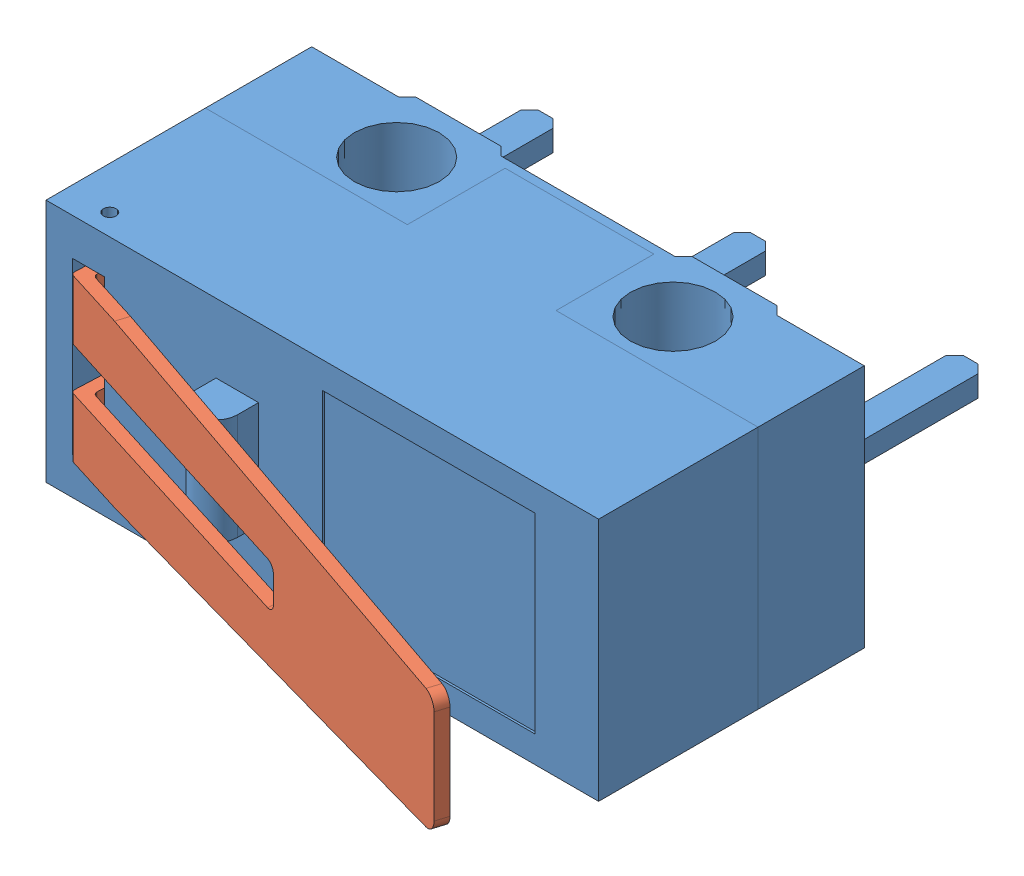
SolidWorks assembly Microsassem.SLDASM, configuration Default (file format 11000). Lengths in mm.
Overall size (13.52 5.8 14.35).
2 component instances, 2 part files, 2 mates.
Components (placement in the parent):
- Micro Switch-1: Micro Switch.SLDPRT [Default] at (5.5673 7.1501 9.4199) size (13.05 5.8 11.25)
- Lever-1: Lever.SLDPRT [Default] at (-0.0622 9.0501 14.6641) x (0.999157 0 0.041042) z (0 -1 0) size (12.63 4.59 4)
Mates (geometry in assembly coordinates):
- Coincident2: coincident: plane of Micro Switch-1 through (-0.3078 5.1501 14.4699) normal (0 1 0); plane of Lever-1 through (0.0672 5.1501 15.1699) normal (0 -1 0)
- Concentric1: concentric: cylinder of Micro Switch-1 through (0.0672 0.0252 15.1699) axis (0 1 0) radius 0.15; cylinder of Lever-1 through (0.0672 9.1501 15.1699) axis (0 -1 0) radius 0.15
